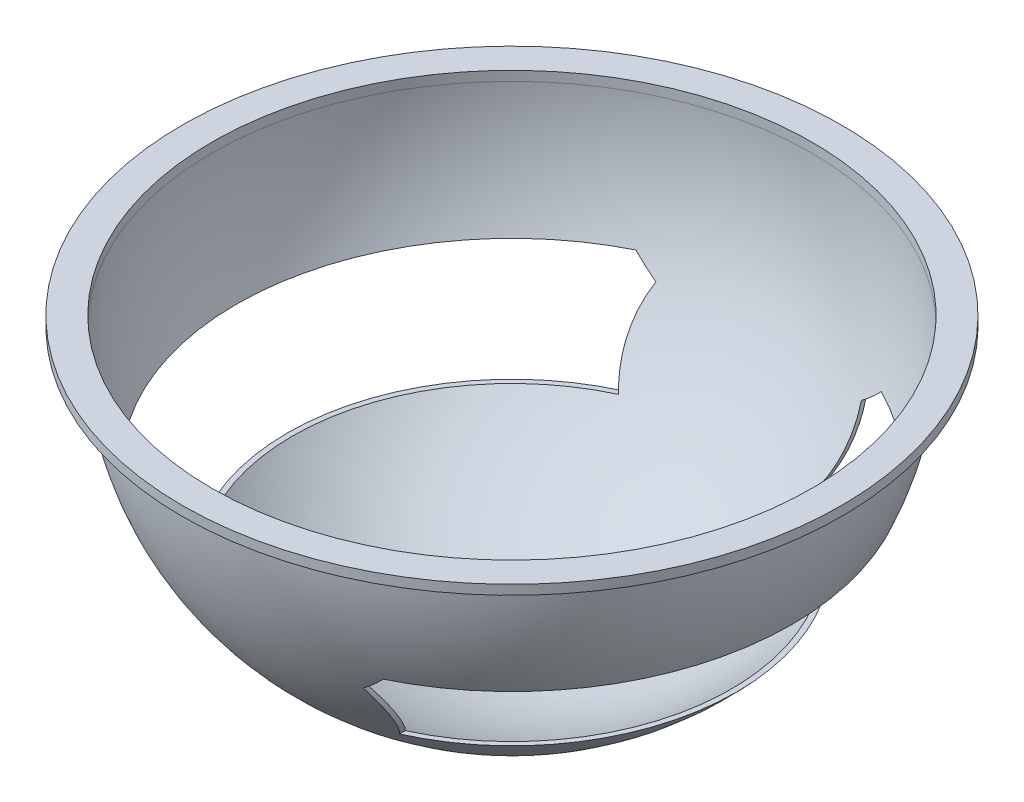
ISO-10303-21;
HEADER;
FILE_DESCRIPTION(('STEP AP214'),'2;1');
FILE_NAME('part.step','',(''),(''),'','','');
FILE_SCHEMA(('AUTOMOTIVE_DESIGN { 1 0 10303 214 1 1 1 1 }'));
ENDSEC;
DATA;
#1=APPLICATION_CONTEXT('core data for automotive mechanical design processes');
#2=APPLICATION_PROTOCOL_DEFINITION('international standard','automotive_design',2000,#1);
#3=PRODUCT_CONTEXT('',#1,'mechanical');
#4=PRODUCT('Part','Part','',(#3));
#5=PRODUCT_RELATED_PRODUCT_CATEGORY('part','',(#4));
#6=PRODUCT_DEFINITION_FORMATION('','',#4);
#7=PRODUCT_DEFINITION_CONTEXT('part definition',#1,'design');
#8=PRODUCT_DEFINITION('design','',#6,#7);
#9=PRODUCT_DEFINITION_SHAPE('','',#8);
#10=(LENGTH_UNIT() NAMED_UNIT(*) SI_UNIT(.MILLI.,.METRE.));
#11=(NAMED_UNIT(*) PLANE_ANGLE_UNIT() SI_UNIT($,.RADIAN.));
#12=(NAMED_UNIT(*) SI_UNIT($,.STERADIAN.) SOLID_ANGLE_UNIT());
#13=UNCERTAINTY_MEASURE_WITH_UNIT(LENGTH_MEASURE(1.E-05),#10,'distance_accuracy_value','');
#14=(GEOMETRIC_REPRESENTATION_CONTEXT(3) GLOBAL_UNCERTAINTY_ASSIGNED_CONTEXT((#13)) GLOBAL_UNIT_ASSIGNED_CONTEXT((#10,
#11,#12)) REPRESENTATION_CONTEXT('',''));
#15=CARTESIAN_POINT('',(0.,0.,0.));
#16=DIRECTION('',(0.,0.,1.));
#17=DIRECTION('',(1.,0.,0.));
#18=AXIS2_PLACEMENT_3D('',#15,#16,#17);
#19=CARTESIAN_POINT('',(0.,0.,0.));
#20=DIRECTION('',(0.,1.,0.));
#21=DIRECTION('',(-1.,0.,0.));
#22=AXIS2_PLACEMENT_3D('',#19,#20,#21);
#23=SPHERICAL_SURFACE('',#22,201.93);
#24=CARTESIAN_POINT('',(0.,-136.017,0.));
#25=DIRECTION('',(0.,-1.,0.));
#26=DIRECTION('',(0.,0.,-1.));
#27=AXIS2_PLACEMENT_3D('',#24,#25,#26);
#28=CIRCLE('',#27,149.248452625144);
#29=CARTESIAN_POINT('',(61.3511633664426,-136.016999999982,136.055633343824));
#30=VERTEX_POINT('',#29);
#31=CARTESIAN_POINT('',(61.3511633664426,-136.016999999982,-136.055633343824));
#32=VERTEX_POINT('',#31);
#33=EDGE_CURVE('E250',#30,#32,#28,.F.);
#34=ORIENTED_EDGE('',*,*,#33,.F.);
#35=CARTESIAN_POINT('',(68.3015377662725,-90.5750704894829,167.053229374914));
#36=CARTESIAN_POINT('',(68.4442290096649,-90.9581047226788,166.787210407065));
#37=CARTESIAN_POINT('',(68.5818803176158,-91.3424624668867,166.520398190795));
#38=CARTESIAN_POINT('',(68.8471326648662,-92.1136086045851,165.985294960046));
#39=CARTESIAN_POINT('',(68.9747337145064,-92.5003969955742,165.717003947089));
#40=CARTESIAN_POINT('',(69.219928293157,-93.2762295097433,165.179022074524));
#41=CARTESIAN_POINT('',(69.3375207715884,-93.6652738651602,164.909331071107));
#42=CARTESIAN_POINT('',(69.5626375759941,-94.4454005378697,164.368697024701));
#43=CARTESIAN_POINT('',(69.6701618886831,-94.8364828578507,164.097753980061));
#44=CARTESIAN_POINT('',(69.8750415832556,-95.6205501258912,163.554736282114));
#45=CARTESIAN_POINT('',(69.9723965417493,-96.0135351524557,163.282661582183));
#46=CARTESIAN_POINT('',(70.1567644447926,-96.8012475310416,162.737548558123));
#47=CARTESIAN_POINT('',(70.243777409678,-97.1959748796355,162.46451023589));
#48=CARTESIAN_POINT('',(70.4891910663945,-98.3825339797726,161.644137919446));
#49=CARTESIAN_POINT('',(70.6319745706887,-99.1767735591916,161.095525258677));
#50=CARTESIAN_POINT('',(70.8755235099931,-100.770018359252,159.996062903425));
#51=CARTESIAN_POINT('',(70.9762913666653,-101.569023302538,159.445213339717));
#52=CARTESIAN_POINT('',(71.1358500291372,-103.170287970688,158.342220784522));
#53=CARTESIAN_POINT('',(71.194642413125,-103.972547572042,157.790077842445));
#54=CARTESIAN_POINT('',(71.2700377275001,-105.57884012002,156.685565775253));
#55=CARTESIAN_POINT('',(71.286642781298,-106.382872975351,156.133196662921));
#56=CARTESIAN_POINT('',(71.2774010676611,-107.991235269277,155.029356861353));
#57=CARTESIAN_POINT('',(71.2515562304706,-108.795564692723,154.477886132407));
#58=CARTESIAN_POINT('',(71.1430127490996,-110.647777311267,153.209282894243));
#59=CARTESIAN_POINT('',(71.0454039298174,-111.695277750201,152.492816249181));
#60=CARTESIAN_POINT('',(70.7781348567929,-113.78492473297,151.065517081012));
#61=CARTESIAN_POINT('',(70.6084718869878,-114.827071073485,150.354684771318));
#62=CARTESIAN_POINT('',(70.1976465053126,-116.902722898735,148.940886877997));
#63=CARTESIAN_POINT('',(69.9564776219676,-117.93622759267,148.237922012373));
#64=CARTESIAN_POINT('',(69.4037781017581,-119.989625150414,146.843265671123));
#65=CARTESIAN_POINT('',(69.0923521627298,-121.009535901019,146.151559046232));
#66=CARTESIAN_POINT('',(68.4000146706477,-123.033879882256,144.78066652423));
#67=CARTESIAN_POINT('',(68.0191103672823,-124.038314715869,144.101479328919));
#68=CARTESIAN_POINT('',(67.1891785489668,-126.028254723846,142.757944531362));
#69=CARTESIAN_POINT('',(66.7401777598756,-127.013767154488,142.093591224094));
#70=CARTESIAN_POINT('',(66.0289905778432,-128.451365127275,141.125859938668));
#71=CARTESIAN_POINT('',(65.792437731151,-128.911946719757,140.816029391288));
#72=CARTESIAN_POINT('',(65.3045922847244,-129.82779661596,140.200364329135));
#73=CARTESIAN_POINT('',(65.0533029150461,-130.283066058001,139.894528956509));
#74=CARTESIAN_POINT('',(64.536149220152,-131.187996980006,139.287054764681));
#75=CARTESIAN_POINT('',(64.2702864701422,-131.637659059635,138.985415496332));
#76=CARTESIAN_POINT('',(63.7244291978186,-132.530533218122,138.386930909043));
#77=CARTESIAN_POINT('',(63.4444531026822,-132.973752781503,138.090079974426));
#78=CARTESIAN_POINT('',(63.0138530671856,-133.633958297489,137.648229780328));
#79=CARTESIAN_POINT('',(62.8685372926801,-133.853270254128,137.501508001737));
#80=CARTESIAN_POINT('',(62.5744273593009,-134.290320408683,137.209207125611));
#81=CARTESIAN_POINT('',(62.4256331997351,-134.508058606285,137.063628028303));
#82=CARTESIAN_POINT('',(62.1245707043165,-134.941968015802,136.773603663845));
#83=CARTESIAN_POINT('',(61.9723016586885,-135.158138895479,136.629158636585));
#84=CARTESIAN_POINT('',(61.6643175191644,-135.588823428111,136.341477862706));
#85=CARTESIAN_POINT('',(61.5086024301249,-135.803337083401,136.198242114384));
#86=CARTESIAN_POINT('',(61.3511633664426,-136.016999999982,136.055633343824));
#87=B_SPLINE_CURVE_WITH_KNOTS('',3,(#35,#36,#37,#38,#39,#40,#41,#42,#43,#44,#45,#46,#47,#48,#49,
#50,#51,#52,#53,#54,#55,#56,#57,#58,#59,#60,#61,#62,#63,#64,#65,#66,#67,#68,#69,#70,#71,#72,#73,
#74,#75,#76,#77,#78,#79,#80,#81,#82,#83,#84,#85,#86),.UNSPECIFIED.,.F.,.F.,(4,2,2,2,2,2,2,2,2,2,
2,2,2,2,2,2,2,2,2,2,2,2,2,2,2,4),(0.,1.46303961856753,2.92607773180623,4.38926922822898,
5.85246265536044,7.31571697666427,8.77896842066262,11.7053565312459,14.6315759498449,
17.5576853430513,20.4836474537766,23.4094765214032,27.2258313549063,31.0423300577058,
34.8591742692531,38.6703677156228,42.4811637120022,46.2904679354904,48.1004863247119,
49.9101094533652,51.7195373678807,53.5266610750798,54.4303402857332,55.3340196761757,
56.237885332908,57.141749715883),.UNSPECIFIED.);
#88=CARTESIAN_POINT('',(68.3015377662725,-90.5750704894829,167.053229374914));
#89=VERTEX_POINT('',#88);
#90=EDGE_CURVE('E238',#89,#30,#87,.T.);
#91=ORIENTED_EDGE('',*,*,#90,.F.);
#92=CARTESIAN_POINT('',(0.,0.,167.053229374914));
#93=DIRECTION('',(0.,0.,-1.));
#94=DIRECTION('',(-1.,0.,0.));
#95=AXIS2_PLACEMENT_3D('',#92,#93,#94);
#96=CIRCLE('',#95,113.441365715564);
#97=CARTESIAN_POINT('',(81.5410311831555,-78.867,167.053229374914));
#98=VERTEX_POINT('',#97);
#99=EDGE_CURVE('E244',#98,#89,#96,.T.);
#100=ORIENTED_EDGE('',*,*,#99,.F.);
#101=CARTESIAN_POINT('',(0.,-78.867,0.));
#102=DIRECTION('',(0.,1.,0.));
#103=DIRECTION('',(0.,0.,1.));
#104=AXIS2_PLACEMENT_3D('',#101,#102,#103);
#105=CIRCLE('',#104,185.89169215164);
#106=CARTESIAN_POINT('',(81.5410311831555,-78.867,-167.053229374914));
#107=VERTEX_POINT('',#106);
#108=EDGE_CURVE('E296',#107,#98,#105,.F.);
#109=ORIENTED_EDGE('',*,*,#108,.F.);
#110=CARTESIAN_POINT('',(0.,0.,-167.053229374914));
#111=DIRECTION('',(0.,0.,1.));
#112=DIRECTION('',(1.,0.,0.));
#113=AXIS2_PLACEMENT_3D('',#110,#111,#112);
#114=CIRCLE('',#113,113.441365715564);
#115=CARTESIAN_POINT('',(68.3015377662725,-90.5750704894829,-167.053229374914));
#116=VERTEX_POINT('',#115);
#117=EDGE_CURVE('E291',#116,#107,#114,.T.);
#118=ORIENTED_EDGE('',*,*,#117,.F.);
#119=CARTESIAN_POINT('',(61.3511633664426,-136.016999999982,-136.055633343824));
#120=CARTESIAN_POINT('',(61.4786660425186,-135.8439691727,-136.171120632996));
#121=CARTESIAN_POINT('',(61.6050332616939,-135.670380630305,-136.28702112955));
#122=CARTESIAN_POINT('',(61.8555064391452,-135.322111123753,-136.519621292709));
#123=CARTESIAN_POINT('',(61.9796123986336,-135.147430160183,-136.636320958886));
#124=CARTESIAN_POINT('',(62.3485515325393,-134.621785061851,-136.98757656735));
#125=CARTESIAN_POINT('',(62.5900075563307,-134.269216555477,-137.2232905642));
#126=CARTESIAN_POINT('',(63.0637693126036,-133.559941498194,-137.697734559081));
#127=CARTESIAN_POINT('',(63.2960743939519,-133.203234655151,-137.93646477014));
#128=CARTESIAN_POINT('',(63.751287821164,-132.485847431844,-138.41689419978));
#129=CARTESIAN_POINT('',(63.9741961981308,-132.125167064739,-138.658593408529));
#130=CARTESIAN_POINT('',(64.4105233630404,-131.399990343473,-139.144852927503));
#131=CARTESIAN_POINT('',(64.6239418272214,-131.035493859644,-139.389413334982));
#132=CARTESIAN_POINT('',(65.0412110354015,-130.302882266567,-139.881245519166));
#133=CARTESIAN_POINT('',(65.2450617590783,-129.934767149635,-140.128517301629));
#134=CARTESIAN_POINT('',(65.8421284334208,-128.825241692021,-140.874230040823));
#135=CARTESIAN_POINT('',(66.2208796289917,-128.078616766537,-141.376591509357));
#136=CARTESIAN_POINT('',(66.9387275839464,-126.57341087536,-142.390502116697));
#137=CARTESIAN_POINT('',(67.2778469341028,-125.814837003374,-142.902045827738));
#138=CARTESIAN_POINT('',(67.9158338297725,-124.286740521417,-143.933742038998));
#139=CARTESIAN_POINT('',(68.2147032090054,-123.517218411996,-144.453894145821));
#140=CARTESIAN_POINT('',(68.7716185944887,-121.968701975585,-145.501809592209));
#141=CARTESIAN_POINT('',(69.0296666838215,-121.189708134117,-146.029572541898));
#142=CARTESIAN_POINT('',(69.5044209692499,-119.623755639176,-147.09170240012));
#143=CARTESIAN_POINT('',(69.7211293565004,-118.836797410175,-147.626068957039));
#144=CARTESIAN_POINT('',(70.1706056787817,-117.023243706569,-148.858881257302));
#145=CARTESIAN_POINT('',(70.3892625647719,-115.994419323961,-149.559241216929));
#146=CARTESIAN_POINT('',(70.7559337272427,-113.929109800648,-150.967136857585));
#147=CARTESIAN_POINT('',(70.9039455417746,-112.892624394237,-151.674672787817));
#148=CARTESIAN_POINT('',(71.1288685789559,-110.815201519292,-153.094728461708));
#149=CARTESIAN_POINT('',(71.2057728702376,-109.774263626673,-153.807248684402));
#150=CARTESIAN_POINT('',(71.2881699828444,-107.692698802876,-155.234004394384));
#151=CARTESIAN_POINT('',(71.2937539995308,-106.65207317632,-155.948236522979));
#152=CARTESIAN_POINT('',(71.2341890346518,-104.57312751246,-157.37683372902));
#153=CARTESIAN_POINT('',(71.1690470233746,-103.534807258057,-158.091198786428));
#154=CARTESIAN_POINT('',(70.9685687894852,-101.463860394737,-159.517592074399));
#155=CARTESIAN_POINT('',(70.833260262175,-100.431231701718,-160.2296211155));
#156=CARTESIAN_POINT('',(70.5802297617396,-98.9040148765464,-161.283993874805));
#157=CARTESIAN_POINT('',(70.4892912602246,-98.4060135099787,-161.628016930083));
#158=CARTESIAN_POINT('',(70.2910131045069,-97.4125088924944,-162.314743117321));
#159=CARTESIAN_POINT('',(70.1836769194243,-96.9170051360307,-162.657446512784));
#160=CARTESIAN_POINT('',(69.9527394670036,-95.9288002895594,-163.341295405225));
#161=CARTESIAN_POINT('',(69.829139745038,-95.4360989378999,-163.682441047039));
#162=CARTESIAN_POINT('',(69.5661681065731,-94.4544011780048,-164.362442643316));
#163=CARTESIAN_POINT('',(69.4268184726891,-93.9654005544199,-164.701301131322));
#164=CARTESIAN_POINT('',(69.1323629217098,-92.990678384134,-165.37698867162));
#165=CARTESIAN_POINT('',(68.9772555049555,-92.504957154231,-165.713817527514));
#166=CARTESIAN_POINT('',(68.6512452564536,-91.5371575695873,-166.385257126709));
#167=CARTESIAN_POINT('',(68.4803395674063,-91.0550798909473,-166.719867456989));
#168=CARTESIAN_POINT('',(68.3015377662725,-90.5750704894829,-167.053229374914));
#169=B_SPLINE_CURVE_WITH_KNOTS('',3,(#119,#120,#121,#122,#123,#124,#125,#126,#127,#128,#129,
#130,#131,#132,#133,#134,#135,#136,#137,#138,#139,#140,#141,#142,#143,#144,#145,#146,#147,#148,
#149,#150,#151,#152,#153,#154,#155,#156,#157,#158,#159,#160,#161,#162,#163,#164,#165,#166,#167,
#168),.UNSPECIFIED.,.F.,.F.,(4,2,2,2,2,2,2,2,2,2,2,2,2,2,2,2,2,2,2,2,2,2,2,2,4),(0.,
0.731979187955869,1.46395798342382,2.92790642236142,4.39195884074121,5.85600641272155,
7.3201038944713,8.78420448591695,11.7122665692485,14.6386513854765,17.5649028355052,
20.4910049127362,23.4169518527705,27.2057800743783,30.9947403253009,34.7840698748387,
38.5685536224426,42.3526644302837,46.1352827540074,47.9713024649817,49.8069342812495,
51.6423918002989,53.4752843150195,55.3083514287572,57.1417507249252),.UNSPECIFIED.);
#170=EDGE_CURVE('E243',#32,#116,#169,.T.);
#171=ORIENTED_EDGE('',*,*,#170,.F.);
#172=EDGE_LOOP('',(#34,#91,#100,#109,#118,#171));
#173=FACE_BOUND('',#172,.T.);
#174=CARTESIAN_POINT('',(0.,-1.41006965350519E-12,0.));
#175=DIRECTION('',(0.,1.,0.));
#176=DIRECTION('',(0.,0.,1.));
#177=AXIS2_PLACEMENT_3D('',#174,#175,#176);
#178=CIRCLE('',#177,201.93);
#179=CARTESIAN_POINT('',(0.,-1.41006965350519E-12,201.93));
#180=VERTEX_POINT('',#179);
#181=EDGE_CURVE('E252',#180,#180,#178,.T.);
#182=ORIENTED_EDGE('',*,*,#181,.F.);
#183=EDGE_LOOP('',(#182));
#184=FACE_BOUND('',#183,.T.);
#185=CARTESIAN_POINT('',(0.,0.,-167.053229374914));
#186=DIRECTION('',(0.,0.,1.));
#187=DIRECTION('',(1.,0.,0.));
#188=AXIS2_PLACEMENT_3D('',#185,#186,#187);
#189=CIRCLE('',#188,113.441365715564);
#190=CARTESIAN_POINT('',(-68.3015377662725,-90.5750704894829,-167.053229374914));
#191=VERTEX_POINT('',#190);
#192=CARTESIAN_POINT('',(-81.5410311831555,-78.867,-167.053229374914));
#193=VERTEX_POINT('',#192);
#194=EDGE_CURVE('E194',#191,#193,#189,.F.);
#195=ORIENTED_EDGE('',*,*,#194,.T.);
#196=CARTESIAN_POINT('',(0.,-78.867,0.));
#197=DIRECTION('',(0.,-1.,0.));
#198=DIRECTION('',(0.,0.,-1.));
#199=AXIS2_PLACEMENT_3D('',#196,#197,#198);
#200=CIRCLE('',#199,185.89169215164);
#201=CARTESIAN_POINT('',(-81.5410311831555,-78.867,167.053229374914));
#202=VERTEX_POINT('',#201);
#203=EDGE_CURVE('E200',#193,#202,#200,.F.);
#204=ORIENTED_EDGE('',*,*,#203,.T.);
#205=CARTESIAN_POINT('',(0.,0.,167.053229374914));
#206=DIRECTION('',(0.,0.,-1.));
#207=DIRECTION('',(-1.,0.,0.));
#208=AXIS2_PLACEMENT_3D('',#205,#206,#207);
#209=CIRCLE('',#208,113.441365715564);
#210=CARTESIAN_POINT('',(-68.3015377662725,-90.5750704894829,167.053229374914));
#211=VERTEX_POINT('',#210);
#212=EDGE_CURVE('E197',#202,#211,#209,.F.);
#213=ORIENTED_EDGE('',*,*,#212,.T.);
#214=CARTESIAN_POINT('',(-68.3015377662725,-90.5750704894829,167.053229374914));
#215=CARTESIAN_POINT('',(-68.4442290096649,-90.9581047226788,166.787210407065));
#216=CARTESIAN_POINT('',(-68.5818803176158,-91.3424624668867,166.520398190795));
#217=CARTESIAN_POINT('',(-68.8471326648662,-92.1136086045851,165.985294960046));
#218=CARTESIAN_POINT('',(-68.9747337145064,-92.5003969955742,165.717003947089));
#219=CARTESIAN_POINT('',(-69.219928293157,-93.2762295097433,165.179022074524));
#220=CARTESIAN_POINT('',(-69.3375207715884,-93.6652738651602,164.909331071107));
#221=CARTESIAN_POINT('',(-69.5626375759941,-94.4454005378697,164.368697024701));
#222=CARTESIAN_POINT('',(-69.6701618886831,-94.8364828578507,164.097753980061));
#223=CARTESIAN_POINT('',(-69.8750415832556,-95.6205501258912,163.554736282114));
#224=CARTESIAN_POINT('',(-69.9723965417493,-96.0135351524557,163.282661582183));
#225=CARTESIAN_POINT('',(-70.1567644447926,-96.8012475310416,162.737548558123));
#226=CARTESIAN_POINT('',(-70.243777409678,-97.1959748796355,162.46451023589));
#227=CARTESIAN_POINT('',(-70.4891910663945,-98.3825339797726,161.644137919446));
#228=CARTESIAN_POINT('',(-70.6319745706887,-99.1767735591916,161.095525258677));
#229=CARTESIAN_POINT('',(-70.8755235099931,-100.770018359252,159.996062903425));
#230=CARTESIAN_POINT('',(-70.9762913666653,-101.569023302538,159.445213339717));
#231=CARTESIAN_POINT('',(-71.1358500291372,-103.170287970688,158.342220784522));
#232=CARTESIAN_POINT('',(-71.194642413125,-103.972547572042,157.790077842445));
#233=CARTESIAN_POINT('',(-71.2700377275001,-105.57884012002,156.685565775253));
#234=CARTESIAN_POINT('',(-71.286642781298,-106.382872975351,156.133196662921));
#235=CARTESIAN_POINT('',(-71.2774010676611,-107.991235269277,155.029356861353));
#236=CARTESIAN_POINT('',(-71.2515562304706,-108.795564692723,154.477886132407));
#237=CARTESIAN_POINT('',(-71.1430127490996,-110.647777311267,153.209282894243));
#238=CARTESIAN_POINT('',(-71.0454039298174,-111.695277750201,152.492816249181));
#239=CARTESIAN_POINT('',(-70.7781348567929,-113.78492473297,151.065517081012));
#240=CARTESIAN_POINT('',(-70.6084718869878,-114.827071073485,150.354684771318));
#241=CARTESIAN_POINT('',(-70.1976465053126,-116.902722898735,148.940886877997));
#242=CARTESIAN_POINT('',(-69.9564776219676,-117.93622759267,148.237922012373));
#243=CARTESIAN_POINT('',(-69.4037781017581,-119.989625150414,146.843265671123));
#244=CARTESIAN_POINT('',(-69.0923521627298,-121.009535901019,146.151559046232));
#245=CARTESIAN_POINT('',(-68.4000146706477,-123.033879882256,144.78066652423));
#246=CARTESIAN_POINT('',(-68.0191103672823,-124.038314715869,144.101479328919));
#247=CARTESIAN_POINT('',(-67.1891785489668,-126.028254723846,142.757944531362));
#248=CARTESIAN_POINT('',(-66.7401777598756,-127.013767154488,142.093591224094));
#249=CARTESIAN_POINT('',(-66.0289905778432,-128.451365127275,141.125859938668));
#250=CARTESIAN_POINT('',(-65.792437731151,-128.911946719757,140.816029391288));
#251=CARTESIAN_POINT('',(-65.3045922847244,-129.82779661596,140.200364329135));
#252=CARTESIAN_POINT('',(-65.0533029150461,-130.283066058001,139.894528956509));
#253=CARTESIAN_POINT('',(-64.536149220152,-131.187996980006,139.287054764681));
#254=CARTESIAN_POINT('',(-64.2702864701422,-131.637659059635,138.985415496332));
#255=CARTESIAN_POINT('',(-63.7244291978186,-132.530533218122,138.386930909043));
#256=CARTESIAN_POINT('',(-63.4444531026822,-132.973752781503,138.090079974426));
#257=CARTESIAN_POINT('',(-63.0138530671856,-133.633958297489,137.648229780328));
#258=CARTESIAN_POINT('',(-62.8685372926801,-133.853270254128,137.501508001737));
#259=CARTESIAN_POINT('',(-62.5744273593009,-134.290320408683,137.209207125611));
#260=CARTESIAN_POINT('',(-62.4256331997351,-134.508058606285,137.063628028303));
#261=CARTESIAN_POINT('',(-62.1245707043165,-134.941968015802,136.773603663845));
#262=CARTESIAN_POINT('',(-61.9723016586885,-135.158138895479,136.629158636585));
#263=CARTESIAN_POINT('',(-61.6643175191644,-135.588823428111,136.341477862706));
#264=CARTESIAN_POINT('',(-61.5086024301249,-135.803337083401,136.198242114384));
#265=CARTESIAN_POINT('',(-61.3511633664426,-136.016999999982,136.055633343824));
#266=B_SPLINE_CURVE_WITH_KNOTS('',3,(#214,#215,#216,#217,#218,#219,#220,#221,#222,#223,#224,
#225,#226,#227,#228,#229,#230,#231,#232,#233,#234,#235,#236,#237,#238,#239,#240,#241,#242,#243,
#244,#245,#246,#247,#248,#249,#250,#251,#252,#253,#254,#255,#256,#257,#258,#259,#260,#261,#262,
#263,#264,#265),.UNSPECIFIED.,.F.,.F.,(4,2,2,2,2,2,2,2,2,2,2,2,2,2,2,2,2,2,2,2,2,2,2,2,2,4),(0.,
1.46303961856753,2.92607773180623,4.38926922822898,5.85246265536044,7.31571697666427,
8.77896842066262,11.7053565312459,14.6315759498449,17.5576853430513,20.4836474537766,
23.4094765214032,27.2258313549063,31.0423300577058,34.8591742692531,38.6703677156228,
42.4811637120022,46.2904679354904,48.1004863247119,49.9101094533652,51.7195373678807,
53.5266610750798,54.4303402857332,55.3340196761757,56.237885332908,57.141749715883),.UNSPECIFIED.);
#267=CARTESIAN_POINT('',(-61.3511633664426,-136.016999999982,136.055633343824));
#268=VERTEX_POINT('',#267);
#269=EDGE_CURVE('E184',#211,#268,#266,.T.);
#270=ORIENTED_EDGE('',*,*,#269,.T.);
#271=CARTESIAN_POINT('',(4.01920657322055E-11,-136.016999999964,0.));
#272=DIRECTION('',(-2.95492958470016E-13,1.,0.));
#273=DIRECTION('',(-1.,-2.95492958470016E-13,0.));
#274=AXIS2_PLACEMENT_3D('',#271,#272,#273);
#275=CIRCLE('',#274,149.248452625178);
#276=CARTESIAN_POINT('',(-61.3511633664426,-136.016999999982,-136.055633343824));
#277=VERTEX_POINT('',#276);
#278=EDGE_CURVE('E182',#268,#277,#275,.F.);
#279=ORIENTED_EDGE('',*,*,#278,.T.);
#280=CARTESIAN_POINT('',(-61.3511633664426,-136.016999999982,-136.055633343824));
#281=CARTESIAN_POINT('',(-61.4786660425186,-135.8439691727,-136.171120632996));
#282=CARTESIAN_POINT('',(-61.6050332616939,-135.670380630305,-136.28702112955));
#283=CARTESIAN_POINT('',(-61.8555064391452,-135.322111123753,-136.519621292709));
#284=CARTESIAN_POINT('',(-61.9796123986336,-135.147430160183,-136.636320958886));
#285=CARTESIAN_POINT('',(-62.3485515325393,-134.621785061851,-136.98757656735));
#286=CARTESIAN_POINT('',(-62.5900075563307,-134.269216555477,-137.2232905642));
#287=CARTESIAN_POINT('',(-63.0637693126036,-133.559941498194,-137.697734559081));
#288=CARTESIAN_POINT('',(-63.2960743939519,-133.203234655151,-137.93646477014));
#289=CARTESIAN_POINT('',(-63.751287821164,-132.485847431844,-138.41689419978));
#290=CARTESIAN_POINT('',(-63.9741961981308,-132.125167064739,-138.658593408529));
#291=CARTESIAN_POINT('',(-64.4105233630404,-131.399990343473,-139.144852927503));
#292=CARTESIAN_POINT('',(-64.6239418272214,-131.035493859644,-139.389413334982));
#293=CARTESIAN_POINT('',(-65.0412110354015,-130.302882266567,-139.881245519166));
#294=CARTESIAN_POINT('',(-65.2450617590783,-129.934767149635,-140.128517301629));
#295=CARTESIAN_POINT('',(-65.8421284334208,-128.825241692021,-140.874230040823));
#296=CARTESIAN_POINT('',(-66.2208796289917,-128.078616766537,-141.376591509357));
#297=CARTESIAN_POINT('',(-66.9387275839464,-126.57341087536,-142.390502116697));
#298=CARTESIAN_POINT('',(-67.2778469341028,-125.814837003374,-142.902045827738));
#299=CARTESIAN_POINT('',(-67.9158338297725,-124.286740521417,-143.933742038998));
#300=CARTESIAN_POINT('',(-68.2147032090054,-123.517218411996,-144.453894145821));
#301=CARTESIAN_POINT('',(-68.7716185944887,-121.968701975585,-145.501809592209));
#302=CARTESIAN_POINT('',(-69.0296666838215,-121.189708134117,-146.029572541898));
#303=CARTESIAN_POINT('',(-69.5044209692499,-119.623755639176,-147.09170240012));
#304=CARTESIAN_POINT('',(-69.7211293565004,-118.836797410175,-147.626068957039));
#305=CARTESIAN_POINT('',(-70.1706056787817,-117.023243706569,-148.858881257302));
#306=CARTESIAN_POINT('',(-70.3892625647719,-115.994419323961,-149.559241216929));
#307=CARTESIAN_POINT('',(-70.7559337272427,-113.929109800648,-150.967136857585));
#308=CARTESIAN_POINT('',(-70.9039455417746,-112.892624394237,-151.674672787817));
#309=CARTESIAN_POINT('',(-71.1288685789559,-110.815201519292,-153.094728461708));
#310=CARTESIAN_POINT('',(-71.2057728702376,-109.774263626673,-153.807248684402));
#311=CARTESIAN_POINT('',(-71.2881699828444,-107.692698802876,-155.234004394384));
#312=CARTESIAN_POINT('',(-71.2937539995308,-106.65207317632,-155.948236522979));
#313=CARTESIAN_POINT('',(-71.2341890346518,-104.57312751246,-157.37683372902));
#314=CARTESIAN_POINT('',(-71.1690470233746,-103.534807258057,-158.091198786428));
#315=CARTESIAN_POINT('',(-70.9685687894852,-101.463860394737,-159.517592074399));
#316=CARTESIAN_POINT('',(-70.833260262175,-100.431231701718,-160.2296211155));
#317=CARTESIAN_POINT('',(-70.5802297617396,-98.9040148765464,-161.283993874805));
#318=CARTESIAN_POINT('',(-70.4892912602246,-98.4060135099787,-161.628016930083));
#319=CARTESIAN_POINT('',(-70.2910131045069,-97.4125088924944,-162.314743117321));
#320=CARTESIAN_POINT('',(-70.1836769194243,-96.9170051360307,-162.657446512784));
#321=CARTESIAN_POINT('',(-69.9527394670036,-95.9288002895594,-163.341295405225));
#322=CARTESIAN_POINT('',(-69.829139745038,-95.4360989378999,-163.682441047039));
#323=CARTESIAN_POINT('',(-69.5661681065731,-94.4544011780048,-164.362442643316));
#324=CARTESIAN_POINT('',(-69.4268184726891,-93.9654005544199,-164.701301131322));
#325=CARTESIAN_POINT('',(-69.1323629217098,-92.990678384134,-165.37698867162));
#326=CARTESIAN_POINT('',(-68.9772555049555,-92.504957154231,-165.713817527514));
#327=CARTESIAN_POINT('',(-68.6512452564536,-91.5371575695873,-166.385257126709));
#328=CARTESIAN_POINT('',(-68.4803395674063,-91.0550798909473,-166.719867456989));
#329=CARTESIAN_POINT('',(-68.3015377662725,-90.5750704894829,-167.053229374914));
#330=B_SPLINE_CURVE_WITH_KNOTS('',3,(#280,#281,#282,#283,#284,#285,#286,#287,#288,#289,#290,
#291,#292,#293,#294,#295,#296,#297,#298,#299,#300,#301,#302,#303,#304,#305,#306,#307,#308,#309,
#310,#311,#312,#313,#314,#315,#316,#317,#318,#319,#320,#321,#322,#323,#324,#325,#326,#327,#328,
#329),.UNSPECIFIED.,.F.,.F.,(4,2,2,2,2,2,2,2,2,2,2,2,2,2,2,2,2,2,2,2,2,2,2,2,4),(0.,
0.731979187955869,1.46395798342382,2.92790642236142,4.39195884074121,5.85600641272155,
7.3201038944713,8.78420448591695,11.7122665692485,14.6386513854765,17.5649028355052,
20.4910049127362,23.4169518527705,27.2057800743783,30.9947403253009,34.7840698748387,
38.5685536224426,42.3526644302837,46.1352827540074,47.9713024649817,49.8069342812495,
51.6423918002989,53.4752843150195,55.3083514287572,57.1417507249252),.UNSPECIFIED.);
#331=EDGE_CURVE('E131',#277,#191,#330,.T.);
#332=ORIENTED_EDGE('',*,*,#331,.T.);
#333=EDGE_LOOP('',(#195,#204,#213,#270,#279,#332));
#334=FACE_BOUND('',#333,.T.);
#335=ADVANCED_FACE('F32',(#173,#184,#334),#23,.T.);
#336=CARTESIAN_POINT('',(0.,0.,0.));
#337=DIRECTION('',(0.,1.,0.));
#338=DIRECTION('',(-1.,0.,0.));
#339=AXIS2_PLACEMENT_3D('',#336,#337,#338);
#340=SPHERICAL_SURFACE('',#339,199.39);
#341=CARTESIAN_POINT('',(0.,-136.017,0.));
#342=DIRECTION('',(0.,-1.,0.));
#343=DIRECTION('',(0.,0.,-1.));
#344=AXIS2_PLACEMENT_3D('',#341,#342,#343);
#345=CIRCLE('',#344,145.793510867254);
#346=CARTESIAN_POINT('',(61.3511633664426,-136.016999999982,-132.256502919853));
#347=VERTEX_POINT('',#346);
#348=CARTESIAN_POINT('',(61.3511633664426,-136.016999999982,132.256502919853));
#349=VERTEX_POINT('',#348);
#350=EDGE_CURVE('E124',#347,#349,#345,.T.);
#351=ORIENTED_EDGE('',*,*,#350,.F.);
#352=CARTESIAN_POINT('',(68.3015377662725,-90.5750704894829,-163.973865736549));
#353=CARTESIAN_POINT('',(68.44335945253,-90.9557699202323,-163.704502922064));
#354=CARTESIAN_POINT('',(68.5801936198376,-91.3377537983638,-163.434333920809));
#355=CARTESIAN_POINT('',(68.8439201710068,-92.1040774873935,-162.892489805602));
#356=CARTESIAN_POINT('',(68.9708125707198,-92.4884172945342,-162.62081469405));
#357=CARTESIAN_POINT('',(69.2146982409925,-93.2592693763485,-162.076043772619));
#358=CARTESIAN_POINT('',(69.3316907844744,-93.6457818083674,-161.802947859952));
#359=CARTESIAN_POINT('',(69.5557260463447,-94.4207769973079,-161.255473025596));
#360=CARTESIAN_POINT('',(69.6627687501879,-94.809259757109,-160.981094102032));
#361=CARTESIAN_POINT('',(69.8668098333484,-95.5880565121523,-160.431175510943));
#362=CARTESIAN_POINT('',(69.9638079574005,-95.9783705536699,-160.155635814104));
#363=CARTESIAN_POINT('',(70.1475947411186,-96.76068059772,-159.603557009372));
#364=CARTESIAN_POINT('',(70.2343834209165,-97.1526765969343,-159.327017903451));
#365=CARTESIAN_POINT('',(70.4793269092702,-98.3309542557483,-158.496089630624));
#366=CARTESIAN_POINT('',(70.6220680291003,-99.1195593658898,-157.940365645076));
#367=CARTESIAN_POINT('',(70.8661122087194,-100.701438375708,-156.826456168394));
#368=CARTESIAN_POINT('',(70.9674134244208,-101.494712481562,-156.268270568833));
#369=CARTESIAN_POINT('',(71.128622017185,-103.084386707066,-155.150414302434));
#370=CARTESIAN_POINT('',(71.1885305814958,-103.880786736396,-154.590743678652));
#371=CARTESIAN_POINT('',(71.2667735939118,-105.475277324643,-153.470959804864));
#372=CARTESIAN_POINT('',(71.285109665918,-106.273367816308,-152.910846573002));
#373=CARTESIAN_POINT('',(71.2799675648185,-107.869811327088,-151.79128006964));
#374=CARTESIAN_POINT('',(71.2564908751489,-108.668164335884,-151.231826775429));
#375=CARTESIAN_POINT('',(71.1533899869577,-110.520053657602,-149.935132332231));
#376=CARTESIAN_POINT('',(71.0581531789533,-111.57318854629,-149.198504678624));
#377=CARTESIAN_POINT('',(70.7948774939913,-113.674074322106,-147.730572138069));
#378=CARTESIAN_POINT('',(70.626835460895,-114.721824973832,-146.999267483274));
#379=CARTESIAN_POINT('',(70.2185088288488,-116.808651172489,-145.544260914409));
#380=CARTESIAN_POINT('',(69.9782175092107,-117.847725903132,-144.820559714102));
#381=CARTESIAN_POINT('',(69.426519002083,-119.912260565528,-143.38422282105));
#382=CARTESIAN_POINT('',(69.1152146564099,-120.937737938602,-142.671572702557));
#383=CARTESIAN_POINT('',(68.4223626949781,-122.973174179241,-141.25864789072));
#384=CARTESIAN_POINT('',(68.0408225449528,-123.983134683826,-140.558371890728));
#385=CARTESIAN_POINT('',(67.208838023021,-125.984084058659,-139.172583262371));
#386=CARTESIAN_POINT('',(66.7584206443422,-126.975080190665,-138.487064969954));
#387=CARTESIAN_POINT('',(66.0449222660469,-128.419975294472,-137.488626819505));
#388=CARTESIAN_POINT('',(65.8078108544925,-128.882398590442,-137.169251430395));
#389=CARTESIAN_POINT('',(65.3187118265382,-129.801936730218,-136.534490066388));
#390=CARTESIAN_POINT('',(65.0667274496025,-130.259052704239,-136.219103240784));
#391=CARTESIAN_POINT('',(64.5480434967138,-131.167681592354,-135.592526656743));
#392=CARTESIAN_POINT('',(64.2813455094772,-131.619195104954,-135.281336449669));
#393=CARTESIAN_POINT('',(63.7336790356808,-132.515763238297,-134.663779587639));
#394=CARTESIAN_POINT('',(63.4527295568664,-132.96082549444,-134.357407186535));
#395=CARTESIAN_POINT('',(63.0205544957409,-133.62379806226,-133.901288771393));
#396=CARTESIAN_POINT('',(62.8746945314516,-133.844032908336,-133.749812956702));
#397=CARTESIAN_POINT('',(62.5794579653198,-134.282929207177,-133.44800927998));
#398=CARTESIAN_POINT('',(62.4300813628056,-134.501590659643,-133.297681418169));
#399=CARTESIAN_POINT('',(62.1278153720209,-134.9373472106,-132.998164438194));
#400=CARTESIAN_POINT('',(61.9749252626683,-135.154441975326,-132.848975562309));
#401=CARTESIAN_POINT('',(61.6656593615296,-135.586974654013,-132.551814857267));
#402=CARTESIAN_POINT('',(61.5092835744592,-135.802412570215,-132.403843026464));
#403=CARTESIAN_POINT('',(61.3511633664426,-136.016999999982,-132.256502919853));
#404=B_SPLINE_CURVE_WITH_KNOTS('',3,(#352,#353,#354,#355,#356,#357,#358,#359,#360,#361,#362,
#363,#364,#365,#366,#367,#368,#369,#370,#371,#372,#373,#374,#375,#376,#377,#378,#379,#380,#381,
#382,#383,#384,#385,#386,#387,#388,#389,#390,#391,#392,#393,#394,#395,#396,#397,#398,#399,#400,
#401,#402,#403),.UNSPECIFIED.,.F.,.F.,(4,2,2,2,2,2,2,2,2,2,2,2,2,2,2,2,2,2,2,2,2,2,2,2,2,4),(0.,
1.46230082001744,2.92459930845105,4.38700509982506,5.84941302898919,7.31185811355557,
8.77430031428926,11.6990579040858,14.6239456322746,17.548749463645,20.4734390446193,
23.3980248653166,27.2619952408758,31.1261331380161,34.9906305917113,38.8495665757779,
42.7080926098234,46.5651103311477,48.3948340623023,50.2241607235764,52.0532902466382,
53.8800412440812,54.7935351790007,55.7070292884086,56.6207125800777,57.5343946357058),.UNSPECIFIED.);
#405=CARTESIAN_POINT('',(68.3015377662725,-90.5750704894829,-163.973865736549));
#406=VERTEX_POINT('',#405);
#407=EDGE_CURVE('E225',#406,#347,#404,.T.);
#408=ORIENTED_EDGE('',*,*,#407,.F.);
#409=CARTESIAN_POINT('',(0.,0.,-163.973865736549));
#410=DIRECTION('',(0.,0.,1.));
#411=DIRECTION('',(1.,0.,0.));
#412=AXIS2_PLACEMENT_3D('',#409,#410,#411);
#413=CIRCLE('',#412,113.441365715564);
#414=CARTESIAN_POINT('',(81.5410311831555,-78.867,-163.973865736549));
#415=VERTEX_POINT('',#414);
#416=EDGE_CURVE('E257',#415,#406,#413,.F.);
#417=ORIENTED_EDGE('',*,*,#416,.F.);
#418=CARTESIAN_POINT('',(0.,-78.867,0.));
#419=DIRECTION('',(0.,1.,0.));
#420=DIRECTION('',(0.,0.,1.));
#421=AXIS2_PLACEMENT_3D('',#418,#419,#420);
#422=CIRCLE('',#421,183.12937615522);
#423=CARTESIAN_POINT('',(81.5410311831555,-78.867,163.973865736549));
#424=VERTEX_POINT('',#423);
#425=EDGE_CURVE('E255',#424,#415,#422,.T.);
#426=ORIENTED_EDGE('',*,*,#425,.F.);
#427=CARTESIAN_POINT('',(0.,0.,163.973865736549));
#428=DIRECTION('',(0.,0.,-1.));
#429=DIRECTION('',(-1.,0.,0.));
#430=AXIS2_PLACEMENT_3D('',#427,#428,#429);
#431=CIRCLE('',#430,113.441365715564);
#432=CARTESIAN_POINT('',(68.3015377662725,-90.5750704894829,163.973865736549));
#433=VERTEX_POINT('',#432);
#434=EDGE_CURVE('E258',#433,#424,#431,.F.);
#435=ORIENTED_EDGE('',*,*,#434,.F.);
#436=CARTESIAN_POINT('',(61.3511633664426,-136.016999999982,132.256502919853));
#437=CARTESIAN_POINT('',(61.4777549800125,-135.845205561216,132.374458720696));
#438=CARTESIAN_POINT('',(61.6032237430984,-135.672866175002,132.492821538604));
#439=CARTESIAN_POINT('',(61.8519255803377,-135.327119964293,132.730333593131));
#440=CARTESIAN_POINT('',(61.9751586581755,-135.153713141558,132.849482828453));
#441=CARTESIAN_POINT('',(62.34151858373,-134.631926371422,133.208067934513));
#442=CARTESIAN_POINT('',(62.5813075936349,-134.281978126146,133.448642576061));
#443=CARTESIAN_POINT('',(63.0518472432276,-133.578041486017,133.932749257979));
#444=CARTESIAN_POINT('',(63.2825974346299,-133.224052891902,134.176281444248));
#445=CARTESIAN_POINT('',(63.7348185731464,-132.512196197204,134.666256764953));
#446=CARTESIAN_POINT('',(63.9562895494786,-132.154328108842,134.912699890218));
#447=CARTESIAN_POINT('',(64.6066601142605,-131.075133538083,135.656227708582));
#448=CARTESIAN_POINT('',(65.0215328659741,-130.348193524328,136.157526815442));
#449=CARTESIAN_POINT('',(65.813209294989,-128.880809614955,137.17026645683));
#450=CARTESIAN_POINT('',(66.1900126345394,-128.140365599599,137.681707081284));
#451=CARTESIAN_POINT('',(66.9046761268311,-126.647525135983,138.713703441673));
#452=CARTESIAN_POINT('',(67.2425486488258,-125.895132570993,139.234256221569));
#453=CARTESIAN_POINT('',(67.8786581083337,-124.379574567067,140.283755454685));
#454=CARTESIAN_POINT('',(68.1768965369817,-123.616409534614,140.812701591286));
#455=CARTESIAN_POINT('',(68.7331931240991,-122.080712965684,141.878012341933));
#456=CARTESIAN_POINT('',(68.9912529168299,-121.30818181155,142.414376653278));
#457=CARTESIAN_POINT('',(69.4666926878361,-119.755205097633,143.493526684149));
#458=CARTESIAN_POINT('',(69.6840743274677,-118.974759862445,144.036312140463));
#459=CARTESIAN_POINT('',(70.1396402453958,-117.1611053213,145.29872561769));
#460=CARTESIAN_POINT('',(70.3629114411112,-116.125501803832,146.020348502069));
#461=CARTESIAN_POINT('',(70.7378563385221,-114.046317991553,147.470699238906));
#462=CARTESIAN_POINT('',(70.8895269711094,-113.002737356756,148.199427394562));
#463=CARTESIAN_POINT('',(71.1207783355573,-110.910830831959,149.661740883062));
#464=CARTESIAN_POINT('',(71.200351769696,-109.862504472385,150.395326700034));
#465=CARTESIAN_POINT('',(71.287052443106,-107.76593053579,151.863986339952));
#466=CARTESIAN_POINT('',(71.2942735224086,-106.7176846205,152.599056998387));
#467=CARTESIAN_POINT('',(71.2369137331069,-104.623274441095,154.069082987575));
#468=CARTESIAN_POINT('',(71.1723401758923,-103.577109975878,154.80403832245));
#469=CARTESIAN_POINT('',(70.9719025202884,-101.490288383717,156.27129788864));
#470=CARTESIAN_POINT('',(70.8360668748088,-100.449629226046,157.003603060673));
#471=CARTESIAN_POINT('',(70.5819877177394,-98.9139329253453,158.085322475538));
#472=CARTESIAN_POINT('',(70.4910845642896,-98.4155195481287,158.436563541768));
#473=CARTESIAN_POINT('',(70.2928352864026,-97.4211285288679,159.137653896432));
#474=CARTESIAN_POINT('',(70.1854926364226,-96.9251503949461,159.487503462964));
#475=CARTESIAN_POINT('',(69.9544930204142,-95.9359340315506,160.185571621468));
#476=CARTESIAN_POINT('',(69.8308376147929,-95.4426955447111,160.533790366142));
#477=CARTESIAN_POINT('',(69.5676973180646,-94.4598551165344,161.227857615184));
#478=CARTESIAN_POINT('',(69.4282346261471,-93.970249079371,161.573708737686));
#479=CARTESIAN_POINT('',(69.1334904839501,-92.9942514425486,162.263306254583));
#480=CARTESIAN_POINT('',(68.9782075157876,-92.5078601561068,162.607052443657));
#481=CARTESIAN_POINT('',(68.6517758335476,-91.5386563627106,163.292250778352));
#482=CARTESIAN_POINT('',(68.4806242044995,-91.0558445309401,163.633702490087));
#483=CARTESIAN_POINT('',(68.3015377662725,-90.5750704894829,163.973865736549));
#484=B_SPLINE_CURVE_WITH_KNOTS('',3,(#436,#437,#438,#439,#440,#441,#442,#443,#444,#445,#446,
#447,#448,#449,#450,#451,#452,#453,#454,#455,#456,#457,#458,#459,#460,#461,#462,#463,#464,#465,
#466,#467,#468,#469,#470,#471,#472,#473,#474,#475,#476,#477,#478,#479,#480,#481,#482,#483),
.UNSPECIFIED.,.F.,.F.,(4,2,2,2,2,2,2,2,2,2,2,2,2,2,2,2,2,2,2,2,2,2,2,4),(0.,0.731477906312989,
1.46295460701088,2.92589951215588,4.38891688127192,5.85192964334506,8.77785870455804,
11.7038137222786,14.6288365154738,17.55374923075,20.4785429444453,23.4032171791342,
27.2465461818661,31.0900399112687,34.9339226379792,38.7728192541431,42.6113249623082,
46.4482992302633,48.2975612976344,50.1464330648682,51.9951281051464,53.8412583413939,
55.6875658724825,57.5342132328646),.UNSPECIFIED.);
#485=EDGE_CURVE('E233',#349,#433,#484,.T.);
#486=ORIENTED_EDGE('',*,*,#485,.F.);
#487=EDGE_LOOP('',(#351,#408,#417,#426,#435,#486));
#488=FACE_BOUND('',#487,.T.);
#489=CARTESIAN_POINT('',(0.,0.,0.));
#490=DIRECTION('',(0.,1.,0.));
#491=DIRECTION('',(0.,0.,1.));
#492=AXIS2_PLACEMENT_3D('',#489,#490,#491);
#493=CIRCLE('',#492,199.39);
#494=CARTESIAN_POINT('',(0.,0.,199.39));
#495=VERTEX_POINT('',#494);
#496=EDGE_CURVE('E480',#495,#495,#493,.T.);
#497=ORIENTED_EDGE('',*,*,#496,.T.);
#498=EDGE_LOOP('',(#497));
#499=FACE_BOUND('',#498,.T.);
#500=CARTESIAN_POINT('',(0.,0.,163.973865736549));
#501=DIRECTION('',(0.,0.,-1.));
#502=DIRECTION('',(-1.,0.,0.));
#503=AXIS2_PLACEMENT_3D('',#500,#501,#502);
#504=CIRCLE('',#503,113.441365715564);
#505=CARTESIAN_POINT('',(-68.3015377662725,-90.5750704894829,163.973865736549));
#506=VERTEX_POINT('',#505);
#507=CARTESIAN_POINT('',(-81.5410311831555,-78.867,163.973865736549));
#508=VERTEX_POINT('',#507);
#509=EDGE_CURVE('E40',#506,#508,#504,.T.);
#510=ORIENTED_EDGE('',*,*,#509,.T.);
#511=CARTESIAN_POINT('',(0.,-78.867,0.));
#512=DIRECTION('',(0.,-1.,0.));
#513=DIRECTION('',(0.,0.,-1.));
#514=AXIS2_PLACEMENT_3D('',#511,#512,#513);
#515=CIRCLE('',#514,183.12937615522);
#516=CARTESIAN_POINT('',(-81.5410311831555,-78.867,-163.973865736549));
#517=VERTEX_POINT('',#516);
#518=EDGE_CURVE('E11',#508,#517,#515,.T.);
#519=ORIENTED_EDGE('',*,*,#518,.T.);
#520=CARTESIAN_POINT('',(0.,0.,-163.973865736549));
#521=DIRECTION('',(0.,0.,1.));
#522=DIRECTION('',(1.,0.,0.));
#523=AXIS2_PLACEMENT_3D('',#520,#521,#522);
#524=CIRCLE('',#523,113.441365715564);
#525=CARTESIAN_POINT('',(-68.3015377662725,-90.5750704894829,-163.973865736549));
#526=VERTEX_POINT('',#525);
#527=EDGE_CURVE('E138',#517,#526,#524,.T.);
#528=ORIENTED_EDGE('',*,*,#527,.T.);
#529=CARTESIAN_POINT('',(-68.3015377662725,-90.5750704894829,-163.973865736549));
#530=CARTESIAN_POINT('',(-68.44335945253,-90.9557699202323,-163.704502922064));
#531=CARTESIAN_POINT('',(-68.5801936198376,-91.3377537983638,-163.434333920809));
#532=CARTESIAN_POINT('',(-68.8439201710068,-92.1040774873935,-162.892489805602));
#533=CARTESIAN_POINT('',(-68.9708125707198,-92.4884172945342,-162.62081469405));
#534=CARTESIAN_POINT('',(-69.2146982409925,-93.2592693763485,-162.076043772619));
#535=CARTESIAN_POINT('',(-69.3316907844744,-93.6457818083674,-161.802947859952));
#536=CARTESIAN_POINT('',(-69.5557260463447,-94.4207769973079,-161.255473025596));
#537=CARTESIAN_POINT('',(-69.6627687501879,-94.809259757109,-160.981094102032));
#538=CARTESIAN_POINT('',(-69.8668098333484,-95.5880565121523,-160.431175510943));
#539=CARTESIAN_POINT('',(-69.9638079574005,-95.9783705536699,-160.155635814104));
#540=CARTESIAN_POINT('',(-70.1475947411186,-96.76068059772,-159.603557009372));
#541=CARTESIAN_POINT('',(-70.2343834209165,-97.1526765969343,-159.327017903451));
#542=CARTESIAN_POINT('',(-70.4793269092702,-98.3309542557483,-158.496089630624));
#543=CARTESIAN_POINT('',(-70.6220680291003,-99.1195593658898,-157.940365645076));
#544=CARTESIAN_POINT('',(-70.8661122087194,-100.701438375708,-156.826456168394));
#545=CARTESIAN_POINT('',(-70.9674134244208,-101.494712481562,-156.268270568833));
#546=CARTESIAN_POINT('',(-71.128622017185,-103.084386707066,-155.150414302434));
#547=CARTESIAN_POINT('',(-71.1885305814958,-103.880786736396,-154.590743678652));
#548=CARTESIAN_POINT('',(-71.2667735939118,-105.475277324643,-153.470959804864));
#549=CARTESIAN_POINT('',(-71.285109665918,-106.273367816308,-152.910846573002));
#550=CARTESIAN_POINT('',(-71.2799675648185,-107.869811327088,-151.79128006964));
#551=CARTESIAN_POINT('',(-71.2564908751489,-108.668164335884,-151.231826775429));
#552=CARTESIAN_POINT('',(-71.1533899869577,-110.520053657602,-149.935132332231));
#553=CARTESIAN_POINT('',(-71.0581531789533,-111.57318854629,-149.198504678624));
#554=CARTESIAN_POINT('',(-70.7948774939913,-113.674074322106,-147.730572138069));
#555=CARTESIAN_POINT('',(-70.626835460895,-114.721824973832,-146.999267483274));
#556=CARTESIAN_POINT('',(-70.2185088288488,-116.808651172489,-145.544260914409));
#557=CARTESIAN_POINT('',(-69.9782175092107,-117.847725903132,-144.820559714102));
#558=CARTESIAN_POINT('',(-69.426519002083,-119.912260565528,-143.38422282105));
#559=CARTESIAN_POINT('',(-69.1152146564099,-120.937737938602,-142.671572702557));
#560=CARTESIAN_POINT('',(-68.4223626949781,-122.973174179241,-141.25864789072));
#561=CARTESIAN_POINT('',(-68.0408225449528,-123.983134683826,-140.558371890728));
#562=CARTESIAN_POINT('',(-67.208838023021,-125.984084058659,-139.172583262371));
#563=CARTESIAN_POINT('',(-66.7584206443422,-126.975080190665,-138.487064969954));
#564=CARTESIAN_POINT('',(-66.0449222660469,-128.419975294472,-137.488626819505));
#565=CARTESIAN_POINT('',(-65.8078108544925,-128.882398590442,-137.169251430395));
#566=CARTESIAN_POINT('',(-65.3187118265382,-129.801936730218,-136.534490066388));
#567=CARTESIAN_POINT('',(-65.0667274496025,-130.259052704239,-136.219103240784));
#568=CARTESIAN_POINT('',(-64.5480434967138,-131.167681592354,-135.592526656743));
#569=CARTESIAN_POINT('',(-64.2813455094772,-131.619195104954,-135.281336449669));
#570=CARTESIAN_POINT('',(-63.7336790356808,-132.515763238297,-134.663779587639));
#571=CARTESIAN_POINT('',(-63.4527295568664,-132.96082549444,-134.357407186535));
#572=CARTESIAN_POINT('',(-63.0205544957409,-133.62379806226,-133.901288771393));
#573=CARTESIAN_POINT('',(-62.8746945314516,-133.844032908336,-133.749812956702));
#574=CARTESIAN_POINT('',(-62.5794579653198,-134.282929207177,-133.44800927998));
#575=CARTESIAN_POINT('',(-62.4300813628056,-134.501590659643,-133.297681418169));
#576=CARTESIAN_POINT('',(-62.1278153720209,-134.9373472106,-132.998164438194));
#577=CARTESIAN_POINT('',(-61.9749252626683,-135.154441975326,-132.848975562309));
#578=CARTESIAN_POINT('',(-61.6656593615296,-135.586974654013,-132.551814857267));
#579=CARTESIAN_POINT('',(-61.5092835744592,-135.802412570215,-132.403843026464));
#580=CARTESIAN_POINT('',(-61.3511633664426,-136.016999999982,-132.256502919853));
#581=B_SPLINE_CURVE_WITH_KNOTS('',3,(#529,#530,#531,#532,#533,#534,#535,#536,#537,#538,#539,
#540,#541,#542,#543,#544,#545,#546,#547,#548,#549,#550,#551,#552,#553,#554,#555,#556,#557,#558,
#559,#560,#561,#562,#563,#564,#565,#566,#567,#568,#569,#570,#571,#572,#573,#574,#575,#576,#577,
#578,#579,#580),.UNSPECIFIED.,.F.,.F.,(4,2,2,2,2,2,2,2,2,2,2,2,2,2,2,2,2,2,2,2,2,2,2,2,2,4),(0.,
1.46230082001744,2.92459930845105,4.38700509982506,5.84941302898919,7.31185811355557,
8.77430031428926,11.6990579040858,14.6239456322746,17.548749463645,20.4734390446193,
23.3980248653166,27.2619952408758,31.1261331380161,34.9906305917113,38.8495665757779,
42.7080926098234,46.5651103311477,48.3948340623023,50.2241607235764,52.0532902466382,
53.8800412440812,54.7935351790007,55.7070292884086,56.6207125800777,57.5343946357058),.UNSPECIFIED.);
#582=CARTESIAN_POINT('',(-61.3511633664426,-136.016999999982,-132.256502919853));
#583=VERTEX_POINT('',#582);
#584=EDGE_CURVE('E123',#526,#583,#581,.T.);
#585=ORIENTED_EDGE('',*,*,#584,.T.);
#586=CARTESIAN_POINT('',(4.01920657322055E-11,-136.016999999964,0.));
#587=DIRECTION('',(-2.95492958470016E-13,1.,0.));
#588=DIRECTION('',(-1.,-2.95492958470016E-13,0.));
#589=AXIS2_PLACEMENT_3D('',#586,#587,#588);
#590=CIRCLE('',#589,145.793510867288);
#591=CARTESIAN_POINT('',(-61.3511633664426,-136.016999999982,132.256502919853));
#592=VERTEX_POINT('',#591);
#593=EDGE_CURVE('E118',#583,#592,#590,.T.);
#594=ORIENTED_EDGE('',*,*,#593,.T.);
#595=CARTESIAN_POINT('',(-61.3511633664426,-136.016999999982,132.256502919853));
#596=CARTESIAN_POINT('',(-61.4777549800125,-135.845205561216,132.374458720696));
#597=CARTESIAN_POINT('',(-61.6032237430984,-135.672866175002,132.492821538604));
#598=CARTESIAN_POINT('',(-61.8519255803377,-135.327119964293,132.730333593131));
#599=CARTESIAN_POINT('',(-61.9751586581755,-135.153713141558,132.849482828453));
#600=CARTESIAN_POINT('',(-62.34151858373,-134.631926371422,133.208067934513));
#601=CARTESIAN_POINT('',(-62.5813075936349,-134.281978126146,133.448642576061));
#602=CARTESIAN_POINT('',(-63.0518472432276,-133.578041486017,133.932749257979));
#603=CARTESIAN_POINT('',(-63.2825974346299,-133.224052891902,134.176281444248));
#604=CARTESIAN_POINT('',(-63.7348185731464,-132.512196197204,134.666256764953));
#605=CARTESIAN_POINT('',(-63.9562895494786,-132.154328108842,134.912699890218));
#606=CARTESIAN_POINT('',(-64.6066601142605,-131.075133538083,135.656227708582));
#607=CARTESIAN_POINT('',(-65.0215328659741,-130.348193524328,136.157526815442));
#608=CARTESIAN_POINT('',(-65.813209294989,-128.880809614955,137.17026645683));
#609=CARTESIAN_POINT('',(-66.1900126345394,-128.140365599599,137.681707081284));
#610=CARTESIAN_POINT('',(-66.9046761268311,-126.647525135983,138.713703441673));
#611=CARTESIAN_POINT('',(-67.2425486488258,-125.895132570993,139.234256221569));
#612=CARTESIAN_POINT('',(-67.8786581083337,-124.379574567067,140.283755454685));
#613=CARTESIAN_POINT('',(-68.1768965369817,-123.616409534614,140.812701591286));
#614=CARTESIAN_POINT('',(-68.7331931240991,-122.080712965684,141.878012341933));
#615=CARTESIAN_POINT('',(-68.9912529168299,-121.30818181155,142.414376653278));
#616=CARTESIAN_POINT('',(-69.4666926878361,-119.755205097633,143.493526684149));
#617=CARTESIAN_POINT('',(-69.6840743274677,-118.974759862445,144.036312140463));
#618=CARTESIAN_POINT('',(-70.1396402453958,-117.1611053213,145.29872561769));
#619=CARTESIAN_POINT('',(-70.3629114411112,-116.125501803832,146.020348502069));
#620=CARTESIAN_POINT('',(-70.7378563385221,-114.046317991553,147.470699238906));
#621=CARTESIAN_POINT('',(-70.8895269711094,-113.002737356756,148.199427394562));
#622=CARTESIAN_POINT('',(-71.1207783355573,-110.910830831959,149.661740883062));
#623=CARTESIAN_POINT('',(-71.200351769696,-109.862504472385,150.395326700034));
#624=CARTESIAN_POINT('',(-71.287052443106,-107.76593053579,151.863986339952));
#625=CARTESIAN_POINT('',(-71.2942735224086,-106.7176846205,152.599056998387));
#626=CARTESIAN_POINT('',(-71.2369137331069,-104.623274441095,154.069082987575));
#627=CARTESIAN_POINT('',(-71.1723401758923,-103.577109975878,154.80403832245));
#628=CARTESIAN_POINT('',(-70.9719025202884,-101.490288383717,156.27129788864));
#629=CARTESIAN_POINT('',(-70.8360668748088,-100.449629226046,157.003603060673));
#630=CARTESIAN_POINT('',(-70.5819877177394,-98.9139329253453,158.085322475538));
#631=CARTESIAN_POINT('',(-70.4910845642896,-98.4155195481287,158.436563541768));
#632=CARTESIAN_POINT('',(-70.2928352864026,-97.4211285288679,159.137653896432));
#633=CARTESIAN_POINT('',(-70.1854926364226,-96.9251503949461,159.487503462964));
#634=CARTESIAN_POINT('',(-69.9544930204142,-95.9359340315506,160.185571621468));
#635=CARTESIAN_POINT('',(-69.8308376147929,-95.4426955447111,160.533790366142));
#636=CARTESIAN_POINT('',(-69.5676973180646,-94.4598551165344,161.227857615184));
#637=CARTESIAN_POINT('',(-69.4282346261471,-93.970249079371,161.573708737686));
#638=CARTESIAN_POINT('',(-69.1334904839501,-92.9942514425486,162.263306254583));
#639=CARTESIAN_POINT('',(-68.9782075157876,-92.5078601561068,162.607052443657));
#640=CARTESIAN_POINT('',(-68.6517758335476,-91.5386563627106,163.292250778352));
#641=CARTESIAN_POINT('',(-68.4806242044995,-91.0558445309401,163.633702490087));
#642=CARTESIAN_POINT('',(-68.3015377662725,-90.5750704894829,163.973865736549));
#643=B_SPLINE_CURVE_WITH_KNOTS('',3,(#595,#596,#597,#598,#599,#600,#601,#602,#603,#604,#605,
#606,#607,#608,#609,#610,#611,#612,#613,#614,#615,#616,#617,#618,#619,#620,#621,#622,#623,#624,
#625,#626,#627,#628,#629,#630,#631,#632,#633,#634,#635,#636,#637,#638,#639,#640,#641,#642),
.UNSPECIFIED.,.F.,.F.,(4,2,2,2,2,2,2,2,2,2,2,2,2,2,2,2,2,2,2,2,2,2,2,4),(0.,0.731477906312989,
1.46295460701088,2.92589951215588,4.38891688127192,5.85192964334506,8.77785870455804,
11.7038137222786,14.6288365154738,17.55374923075,20.4785429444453,23.4032171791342,
27.2465461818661,31.0900399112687,34.9339226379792,38.7728192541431,42.6113249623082,
46.4482992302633,48.2975612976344,50.1464330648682,51.9951281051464,53.8412583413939,
55.6875658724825,57.5342132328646),.UNSPECIFIED.);
#644=EDGE_CURVE('E139',#592,#506,#643,.T.);
#645=ORIENTED_EDGE('',*,*,#644,.T.);
#646=EDGE_LOOP('',(#510,#519,#528,#585,#594,#645));
#647=FACE_BOUND('',#646,.T.);
#648=ADVANCED_FACE('F137',(#488,#499,#647),#340,.F.);
#649=CARTESIAN_POINT('',(68.3015377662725,-90.5750704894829,-201.93));
#650=CARTESIAN_POINT('',(68.9966590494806,-92.4408541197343,-201.93));
#651=CARTESIAN_POINT('',(70.1642356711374,-96.2828042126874,-201.93));
#652=CARTESIAN_POINT('',(71.1526737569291,-102.09234177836,-201.93));
#653=CARTESIAN_POINT('',(71.3964554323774,-107.95717061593,-201.93));
#654=CARTESIAN_POINT('',(70.8884776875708,-113.809427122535,-201.93));
#655=CARTESIAN_POINT('',(69.6323647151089,-119.602149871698,-201.93));
#656=CARTESIAN_POINT('',(67.6346138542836,-125.279529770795,-201.93));
#657=CARTESIAN_POINT('',(65.3591388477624,-129.871115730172,-201.93));
#658=CARTESIAN_POINT('',(63.1872938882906,-133.423807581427,-201.93));
#659=CARTESIAN_POINT('',(61.9772778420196,-135.167325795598,-201.93));
#660=CARTESIAN_POINT('',(61.3511633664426,-136.016999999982,-201.93));
#661=B_SPLINE_CURVE_WITH_KNOTS('',3,(#649,#650,#651,#652,#653,#654,#655,#656,#657,#658,#659,
#660),.UNSPECIFIED.,.F.,.F.,(4,1,1,1,1,1,1,1,1,4),(2.5985133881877,2.7034242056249,
2.8083350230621,2.91324584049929,3.01815665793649,3.12306747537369,3.22797829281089,
3.33288911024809,3.38534451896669,3.43779992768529),.UNSPECIFIED.);
#662=DIRECTION('',(0.,0.,1.));
#663=VECTOR('',#662,1.);
#664=SURFACE_OF_LINEAR_EXTRUSION('',#661,#663);
#665=ORIENTED_EDGE('',*,*,#90,.T.);
#666=DIRECTION('',(0.,0.,1.));
#667=VECTOR('',#666,1.);
#668=CARTESIAN_POINT('',(61.3511633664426,-136.016999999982,-201.93));
#669=LINE('',#668,#667);
#670=EDGE_CURVE('E208',#349,#30,#669,.T.);
#671=ORIENTED_EDGE('',*,*,#670,.F.);
#672=ORIENTED_EDGE('',*,*,#485,.T.);
#673=DIRECTION('',(0.,0.,1.));
#674=VECTOR('',#673,1.);
#675=CARTESIAN_POINT('',(68.3015377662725,-90.5750704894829,-201.93));
#676=LINE('',#675,#674);
#677=EDGE_CURVE('E293',#433,#89,#676,.T.);
#678=ORIENTED_EDGE('',*,*,#677,.T.);
#679=EDGE_LOOP('',(#665,#671,#672,#678));
#680=FACE_BOUND('',#679,.T.);
#681=ADVANCED_FACE('F221',(#680),#664,.F.);
#682=CARTESIAN_POINT('',(0.,0.,-201.93));
#683=DIRECTION('',(0.,0.,1.));
#684=DIRECTION('',(1.,0.,0.));
#685=AXIS2_PLACEMENT_3D('',#682,#683,#684);
#686=CYLINDRICAL_SURFACE('',#685,113.441365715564);
#687=ORIENTED_EDGE('',*,*,#99,.T.);
#688=ORIENTED_EDGE('',*,*,#677,.F.);
#689=ORIENTED_EDGE('',*,*,#434,.T.);
#690=DIRECTION('',(0.,0.,1.));
#691=VECTOR('',#690,1.);
#692=CARTESIAN_POINT('',(81.5410311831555,-78.867,-201.93));
#693=LINE('',#692,#691);
#694=EDGE_CURVE('E203',#424,#98,#693,.T.);
#695=ORIENTED_EDGE('',*,*,#694,.T.);
#696=EDGE_LOOP('',(#687,#688,#689,#695));
#697=FACE_BOUND('',#696,.T.);
#698=ADVANCED_FACE('F298',(#697),#686,.T.);
#699=CARTESIAN_POINT('',(209.512820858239,-136.017,-201.93));
#700=DIRECTION('',(0.,-1.,0.));
#701=DIRECTION('',(0.,0.,-1.));
#702=AXIS2_PLACEMENT_3D('',#699,#700,#701);
#703=PLANE('',#702);
#704=ORIENTED_EDGE('',*,*,#33,.T.);
#705=EDGE_CURVE('E277',#32,#347,#669,.T.);
#706=ORIENTED_EDGE('',*,*,#705,.T.);
#707=ORIENTED_EDGE('',*,*,#350,.T.);
#708=ORIENTED_EDGE('',*,*,#670,.T.);
#709=EDGE_LOOP('',(#704,#706,#707,#708));
#710=FACE_BOUND('',#709,.T.);
#711=ADVANCED_FACE('F219',(#710),#703,.F.);
#712=ORIENTED_EDGE('',*,*,#170,.T.);
#713=EDGE_CURVE('E280',#116,#406,#676,.T.);
#714=ORIENTED_EDGE('',*,*,#713,.T.);
#715=ORIENTED_EDGE('',*,*,#407,.T.);
#716=ORIENTED_EDGE('',*,*,#705,.F.);
#717=EDGE_LOOP('',(#712,#714,#715,#716));
#718=FACE_BOUND('',#717,.T.);
#719=ADVANCED_FACE('F214',(#718),#664,.F.);
#720=ORIENTED_EDGE('',*,*,#117,.T.);
#721=EDGE_CURVE('E286',#107,#415,#693,.T.);
#722=ORIENTED_EDGE('',*,*,#721,.T.);
#723=ORIENTED_EDGE('',*,*,#416,.T.);
#724=ORIENTED_EDGE('',*,*,#713,.F.);
#725=EDGE_LOOP('',(#720,#722,#723,#724));
#726=FACE_BOUND('',#725,.T.);
#727=ADVANCED_FACE('F218',(#726),#686,.T.);
#728=CARTESIAN_POINT('',(183.067713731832,-78.867,-201.93));
#729=DIRECTION('',(0.,1.,0.));
#730=DIRECTION('',(0.,0.,1.));
#731=AXIS2_PLACEMENT_3D('',#728,#729,#730);
#732=PLANE('',#731);
#733=ORIENTED_EDGE('',*,*,#108,.T.);
#734=ORIENTED_EDGE('',*,*,#694,.F.);
#735=ORIENTED_EDGE('',*,*,#425,.T.);
#736=ORIENTED_EDGE('',*,*,#721,.F.);
#737=EDGE_LOOP('',(#733,#734,#735,#736));
#738=FACE_BOUND('',#737,.T.);
#739=ADVANCED_FACE('F285',(#738),#732,.F.);
#740=CARTESIAN_POINT('',(0.,0.,-201.93));
#741=DIRECTION('',(0.,0.,1.));
#742=DIRECTION('',(1.,0.,0.));
#743=AXIS2_PLACEMENT_3D('',#740,#741,#742);
#744=CYLINDRICAL_SURFACE('',#743,113.441365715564);
#745=DIRECTION('',(0.,0.,1.));
#746=VECTOR('',#745,1.);
#747=CARTESIAN_POINT('',(-81.5410311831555,-78.867,-201.93));
#748=LINE('',#747,#746);
#749=EDGE_CURVE('E171',#508,#202,#748,.T.);
#750=ORIENTED_EDGE('',*,*,#749,.F.);
#751=ORIENTED_EDGE('',*,*,#509,.F.);
#752=DIRECTION('',(0.,0.,1.));
#753=VECTOR('',#752,1.);
#754=CARTESIAN_POINT('',(-68.3015377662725,-90.5750704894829,-201.93));
#755=LINE('',#754,#753);
#756=EDGE_CURVE('E133',#506,#211,#755,.T.);
#757=ORIENTED_EDGE('',*,*,#756,.T.);
#758=ORIENTED_EDGE('',*,*,#212,.F.);
#759=EDGE_LOOP('',(#750,#751,#757,#758));
#760=FACE_BOUND('',#759,.T.);
#761=ADVANCED_FACE('F313',(#760),#744,.T.);
#762=CARTESIAN_POINT('',(-68.3015377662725,-90.5750704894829,-201.93));
#763=CARTESIAN_POINT('',(-68.9966590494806,-92.4408541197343,-201.93));
#764=CARTESIAN_POINT('',(-70.1642356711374,-96.2828042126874,-201.93));
#765=CARTESIAN_POINT('',(-71.1526737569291,-102.09234177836,-201.93));
#766=CARTESIAN_POINT('',(-71.3964554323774,-107.95717061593,-201.93));
#767=CARTESIAN_POINT('',(-70.8884776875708,-113.809427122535,-201.93));
#768=CARTESIAN_POINT('',(-69.6323647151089,-119.602149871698,-201.93));
#769=CARTESIAN_POINT('',(-67.6346138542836,-125.279529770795,-201.93));
#770=CARTESIAN_POINT('',(-65.3591388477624,-129.871115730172,-201.93));
#771=CARTESIAN_POINT('',(-63.1872938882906,-133.423807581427,-201.93));
#772=CARTESIAN_POINT('',(-61.9772778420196,-135.167325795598,-201.93));
#773=CARTESIAN_POINT('',(-61.3511633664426,-136.016999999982,-201.93));
#774=B_SPLINE_CURVE_WITH_KNOTS('',3,(#762,#763,#764,#765,#766,#767,#768,#769,#770,#771,#772,
#773),.UNSPECIFIED.,.F.,.F.,(4,1,1,1,1,1,1,1,1,4),(2.5985133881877,2.7034242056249,
2.8083350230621,2.91324584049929,3.01815665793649,3.12306747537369,3.22797829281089,
3.33288911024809,3.38534451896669,3.43779992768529),.UNSPECIFIED.);
#775=DIRECTION('',(0.,0.,1.));
#776=VECTOR('',#775,1.);
#777=SURFACE_OF_LINEAR_EXTRUSION('',#774,#776);
#778=ORIENTED_EDGE('',*,*,#756,.F.);
#779=ORIENTED_EDGE('',*,*,#644,.F.);
#780=DIRECTION('',(0.,0.,1.));
#781=VECTOR('',#780,1.);
#782=CARTESIAN_POINT('',(-61.3511633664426,-136.016999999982,-201.93));
#783=LINE('',#782,#781);
#784=EDGE_CURVE('E52',#592,#268,#783,.T.);
#785=ORIENTED_EDGE('',*,*,#784,.T.);
#786=ORIENTED_EDGE('',*,*,#269,.F.);
#787=EDGE_LOOP('',(#778,#779,#785,#786));
#788=FACE_BOUND('',#787,.T.);
#789=ADVANCED_FACE('F159',(#788),#777,.T.);
#790=CARTESIAN_POINT('',(-183.067713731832,-78.867,-201.93));
#791=DIRECTION('',(0.,-1.,0.));
#792=DIRECTION('',(0.,0.,-1.));
#793=AXIS2_PLACEMENT_3D('',#790,#791,#792);
#794=PLANE('',#793);
#795=EDGE_CURVE('E177',#193,#517,#748,.T.);
#796=ORIENTED_EDGE('',*,*,#795,.T.);
#797=ORIENTED_EDGE('',*,*,#518,.F.);
#798=ORIENTED_EDGE('',*,*,#749,.T.);
#799=ORIENTED_EDGE('',*,*,#203,.F.);
#800=EDGE_LOOP('',(#796,#797,#798,#799));
#801=FACE_BOUND('',#800,.T.);
#802=ADVANCED_FACE('F309',(#801),#794,.T.);
#803=EDGE_CURVE('E178',#191,#526,#755,.T.);
#804=ORIENTED_EDGE('',*,*,#803,.T.);
#805=ORIENTED_EDGE('',*,*,#527,.F.);
#806=ORIENTED_EDGE('',*,*,#795,.F.);
#807=ORIENTED_EDGE('',*,*,#194,.F.);
#808=EDGE_LOOP('',(#804,#805,#806,#807));
#809=FACE_BOUND('',#808,.T.);
#810=ADVANCED_FACE('F158',(#809),#744,.T.);
#811=EDGE_CURVE('E47',#277,#583,#783,.T.);
#812=ORIENTED_EDGE('',*,*,#811,.T.);
#813=ORIENTED_EDGE('',*,*,#584,.F.);
#814=ORIENTED_EDGE('',*,*,#803,.F.);
#815=ORIENTED_EDGE('',*,*,#331,.F.);
#816=EDGE_LOOP('',(#812,#813,#814,#815));
#817=FACE_BOUND('',#816,.T.);
#818=ADVANCED_FACE('F127',(#817),#777,.T.);
#819=CARTESIAN_POINT('',(-61.3511633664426,-136.016999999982,-201.93));
#820=DIRECTION('',(-2.95492958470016E-13,1.,0.));
#821=DIRECTION('',(-1.,-2.95492958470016E-13,0.));
#822=AXIS2_PLACEMENT_3D('',#819,#820,#821);
#823=PLANE('',#822);
#824=ORIENTED_EDGE('',*,*,#784,.F.);
#825=ORIENTED_EDGE('',*,*,#593,.F.);
#826=ORIENTED_EDGE('',*,*,#811,.F.);
#827=ORIENTED_EDGE('',*,*,#278,.F.);
#828=EDGE_LOOP('',(#824,#825,#826,#827));
#829=FACE_BOUND('',#828,.T.);
#830=ADVANCED_FACE('F119',(#829),#823,.T.);
#831=CARTESIAN_POINT('',(0.,6.35,0.));
#832=DIRECTION('',(0.,1.,0.));
#833=DIRECTION('',(0.,0.,1.));
#834=AXIS2_PLACEMENT_3D('',#831,#832,#833);
#835=PLANE('',#834);
#836=CARTESIAN_POINT('',(0.,6.35,0.));
#837=DIRECTION('',(0.,1.,0.));
#838=DIRECTION('',(0.,0.,1.));
#839=AXIS2_PLACEMENT_3D('',#836,#837,#838);
#840=CIRCLE('',#839,219.075);
#841=CARTESIAN_POINT('',(0.,6.35,219.075));
#842=VERTEX_POINT('',#841);
#843=EDGE_CURVE('E181',#842,#842,#840,.T.);
#844=ORIENTED_EDGE('',*,*,#843,.T.);
#845=EDGE_LOOP('',(#844));
#846=FACE_BOUND('',#845,.T.);
#847=CARTESIAN_POINT('',(0.,6.35,0.));
#848=DIRECTION('',(0.,1.,0.));
#849=DIRECTION('',(0.,0.,1.));
#850=AXIS2_PLACEMENT_3D('',#847,#848,#849);
#851=CIRCLE('',#850,199.39);
#852=CARTESIAN_POINT('',(0.,6.35,199.39));
#853=VERTEX_POINT('',#852);
#854=EDGE_CURVE('E477',#853,#853,#851,.T.);
#855=ORIENTED_EDGE('',*,*,#854,.F.);
#856=EDGE_LOOP('',(#855));
#857=FACE_BOUND('',#856,.T.);
#858=ADVANCED_FACE('F338',(#846,#857),#835,.T.);
#859=CARTESIAN_POINT('',(0.,0.,0.));
#860=DIRECTION('',(0.,1.,0.));
#861=DIRECTION('',(0.,0.,1.));
#862=AXIS2_PLACEMENT_3D('',#859,#860,#861);
#863=PLANE('',#862);
#864=ORIENTED_EDGE('',*,*,#181,.T.);
#865=EDGE_LOOP('',(#864));
#866=FACE_BOUND('',#865,.T.);
#867=CARTESIAN_POINT('',(0.,0.,0.));
#868=DIRECTION('',(0.,1.,0.));
#869=DIRECTION('',(0.,0.,1.));
#870=AXIS2_PLACEMENT_3D('',#867,#868,#869);
#871=CIRCLE('',#870,219.075);
#872=CARTESIAN_POINT('',(0.,0.,219.075));
#873=VERTEX_POINT('',#872);
#874=EDGE_CURVE('E169',#873,#873,#871,.T.);
#875=ORIENTED_EDGE('',*,*,#874,.F.);
#876=EDGE_LOOP('',(#875));
#877=FACE_BOUND('',#876,.T.);
#878=ADVANCED_FACE('F344',(#866,#877),#863,.F.);
#879=CARTESIAN_POINT('',(0.,6.35,0.));
#880=DIRECTION('',(0.,-1.,0.));
#881=DIRECTION('',(0.,0.,-1.));
#882=AXIS2_PLACEMENT_3D('',#879,#880,#881);
#883=CYLINDRICAL_SURFACE('',#882,219.075);
#884=ORIENTED_EDGE('',*,*,#843,.F.);
#885=EDGE_LOOP('',(#884));
#886=FACE_BOUND('',#885,.T.);
#887=ORIENTED_EDGE('',*,*,#874,.T.);
#888=EDGE_LOOP('',(#887));
#889=FACE_BOUND('',#888,.T.);
#890=ADVANCED_FACE('F352',(#886,#889),#883,.T.);
#891=CARTESIAN_POINT('',(0.,6.35,0.));
#892=DIRECTION('',(0.,-1.,0.));
#893=DIRECTION('',(0.,0.,-1.));
#894=AXIS2_PLACEMENT_3D('',#891,#892,#893);
#895=CYLINDRICAL_SURFACE('',#894,199.39);
#896=ORIENTED_EDGE('',*,*,#854,.T.);
#897=EDGE_LOOP('',(#896));
#898=FACE_BOUND('',#897,.T.);
#899=ORIENTED_EDGE('',*,*,#496,.F.);
#900=EDGE_LOOP('',(#899));
#901=FACE_BOUND('',#900,.T.);
#902=ADVANCED_FACE('F360',(#898,#901),#895,.F.);
#903=CLOSED_SHELL('',(#335,#648,#681,#698,#711,#719,#727,#739,#761,#789,#802,#810,#818,#830,
#858,#878,#890,#902));
#904=MANIFOLD_SOLID_BREP('B2',#903);
#905=ADVANCED_BREP_SHAPE_REPRESENTATION('',(#18,#904),#14);
#906=SHAPE_DEFINITION_REPRESENTATION(#9,#905);
ENDSEC;
END-ISO-10303-21;
